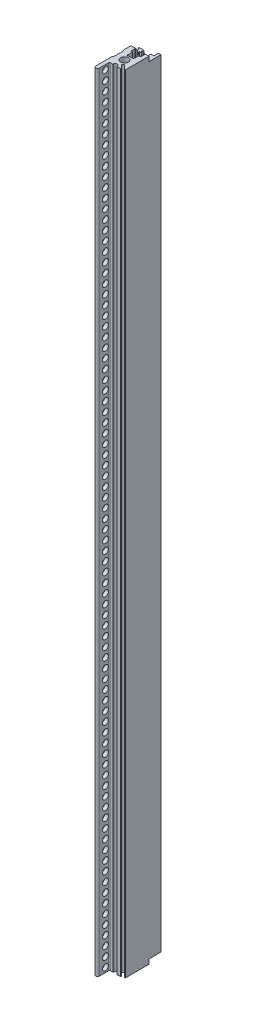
from build123d import *

# Parameters (mm, degrees)
SKETCH_1_R          = 1.6
EXTRUDE_1_DEPTH     = 215.9
SKETCH_7_W          = 5.4
SKETCH_7_H          = 2.5
SKETCH_7_H_2        = 1.2
CUT_EXTRUDE_6_DEPTH = 433.0893889
FILLET_1_R          = 0.2
SKETCH_2_R          = 2.1
CUT_EXTRUDE_1_DEPTH = 10
CUT_EXTRUDE_START   = -10
SKETCH_3_R          = 2.1
CUT_EXTRUDE_2_DEPTH = 10
SKETCH_4_R          = 1.65
CUT_EXTRUDE_3_DEPTH = 12
SKETCH_5_W          = 6.5
SKETCH_5_H          = 2.54
CUT_EXTRUDE_4_DEPTH = 10


with BuildPart() as part:
    # Sketch 1 → Extrude 1 (new, symmetric)
    with BuildSketch(Plane(origin=(0, 0, 0), x_dir=(1, 0, 0), z_dir=(0, 1, 0))):
        with BuildLine():
            Line((-4.20000049, 11.89999994), (-3.89999944, 11.899999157))
            ThreePointArc((-3.89999944, 11.899999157), (-3.758578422, 11.841420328), (-3.699999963, 11.699999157))
            Line((-3.699999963, 11.699999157), (-3.699999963, 9.94999994))
            ThreePointArc((-3.699999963, 9.94999994), (-3.758578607, 9.808578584), (-3.899999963, 9.74999994))
            Line((-3.899999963, 9.74999994), (-4.25, 9.74999994))
            ThreePointArc((-4.25, 9.74999994), (-4.391421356, 9.691421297), (-4.45, 9.54999994))
            Line((-4.45, 9.54999994), (-4.45, 8.5))
            Line((-4.45, 8.5), (-4.7, 8.5))
            Line((-4.7, 8.5), (-5, 8.2))
            Line((-5, 8.2), (-5, 7.4))
            Line((-5, 7.4), (-5, 4.4))
            Line((-5, 4.4), (-4.549867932, 3.899804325))
            Line((-4.549867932, 3.899804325), (-4.550132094, -1.100195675))
            Line((-4.550132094, -1.100195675), (-5, -1.6))
            Line((-5, -1.6), (-5, -10.75))
            ThreePointArc((-5, -10.75), (-4, -11.75), (-3, -10.75))
            Line((-3, -10.75), (-3, -5.75))
            ThreePointArc((-3, -5.75), (-2.853553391, -5.396446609), (-2.5, -5.25))
            Line((-2.5, -5.25), (-1.15000013, -5.25))
            ThreePointArc((-1.15000013, -5.25), (-1.079289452, -5.220710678), (-1.05000013, -5.15))
            Line((-1.05000013, -5.15), (-1.05000013, -5))
            ThreePointArc((-1.05000013, -5), (-1.3e-07, -3.95), (1.04999987, -5))
            Line((1.04999987, -5), (1.04999987, -5.15))
            ThreePointArc((1.04999987, -5.15), (1.079289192, -5.220710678), (1.14999987, -5.25))
            Line((1.14999987, -5.25), (3.070348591, -5.25))
            ThreePointArc((3.070348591, -5.25), (3.255124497, -5.126536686), (3.211769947, -4.908578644))
            Line((3.211769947, -4.908578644), (1.688730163, -3.385538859))
            ThreePointArc((1.688730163, -3.385538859), (1.688730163, -2.537010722), (2.5372583, -2.537010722))
            Line((2.5372583, -2.537010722), (4.658578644, -4.658331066))
            ThreePointArc((4.658578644, -4.658331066), (4.876536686, -4.701685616), (5, -4.516909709))
            Line((5, -4.516909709), (5, -2.080961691))
            Line((5, -2.080961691), (5, 5.179349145))
            Line((5, 5.179349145), (5, 15))
            Line((5, 15), (3.59999987, 15))
            Line((3.59999987, 15), (3.59999987, 12.5))
            Line((3.59999987, 12.5), (1.94999987, 12.5))
            Line((1.94999987, 12.5), (1.94999987, 10.55))
            Line((1.94999987, 10.55), (2.84999987, 10.55))
            Line((2.84999987, 10.55), (2.84999987, 9.35))
            Line((2.84999987, 9.35), (1.94999987, 9.35))
            Line((1.94999987, 9.35), (1.94999987, 8.35))
            Line((1.94999987, 8.35), (2.84999987, 8.35))
            Line((2.84999987, 8.35), (2.84999987, 6.05))
            Line((2.84999987, 6.05), (1.94999987, 6.05))
            Line((1.94999987, 6.05), (1.94999987, 3.885550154))
            ThreePointArc((1.94999987, 3.885550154), (1.567454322, 3.098943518), (0.71249987, 2.914162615))
            ThreePointArc((0.71249987, 2.914162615), (-0.242015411, 2.990222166), (-1.17187513, 2.761649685))
            ThreePointArc((-1.17187513, 2.761649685), (-1.360397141, 2.778988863), (-1.45000013, 2.945759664))
            Line((-1.45000013, 2.945759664), (-1.45000013, 6.05))
            Line((-1.45000013, 6.05), (-2.35000013, 6.05))
            Line((-2.35000013, 6.05), (-2.35000013, 8.35))
            Line((-2.35000013, 8.35), (-1.45000013, 8.35))
            Line((-1.45000013, 8.35), (-1.45000013, 9.35))
            Line((-1.45000013, 9.35), (-2.35000013, 9.35))
            Line((-2.35000013, 9.35), (-2.35000013, 10.55))
            Line((-2.35000013, 10.55), (-1.300000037, 10.55))
            Line((-1.300000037, 10.55), (-1.300000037, 10.617157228))
            ThreePointArc((-1.300000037, 10.617157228), (-1.315224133, 10.693693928), (-1.358578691, 10.758578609))
            Line((-1.358578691, 10.758578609), (-1.941421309, 11.341421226))
            ThreePointArc((-1.941421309, 11.341421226), (-1.984775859, 11.406305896), (-1.999999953, 11.482842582))
            Line((-1.999999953, 11.482842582), (-1.999999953, 11.699999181))
            ThreePointArc((-1.999999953, 11.699999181), (-1.941421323, 11.841420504), (-1.8, 11.899999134))
            Line((-1.8, 11.899999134), (-1.7, 11.899999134))
            ThreePointArc((-1.7, 11.899999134), (-1.558578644, 11.958577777), (-1.5, 12.099999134))
            Line((-1.5, 12.099999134), (-1.5, 12.199999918))
            ThreePointArc((-1.5, 12.199999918), (-1.558578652, 12.341421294), (-1.700000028, 12.399999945))
            Line((-1.700000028, 12.399999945), (-1.867157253, 12.399999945))
            ThreePointArc((-1.867157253, 12.399999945), (-1.943693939, 12.415224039), (-2.008578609, 12.458578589))
            Line((-2.008578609, 12.458578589), (-2.050000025, 12.500000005))
            Line((-2.050000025, 12.500000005), (-3.849999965, 12.500000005))
            Line((-3.849999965, 12.500000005), (-3.891421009, 12.458578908))
            ThreePointArc((-3.891421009, 12.458578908), (-3.95630571, 12.415224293), (-4.032842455, 12.400000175))
            Line((-4.032842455, 12.400000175), (-4.199999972, 12.400000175))
            ThreePointArc((-4.199999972, 12.400000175), (-4.341421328, 12.341421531), (-4.399999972, 12.200000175))
            Line((-4.399999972, 12.200000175), (-4.399999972, 12.099999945))
            ThreePointArc((-4.399999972, 12.099999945), (-4.341421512, 11.95857877), (-4.20000049, 11.89999994))
        make_face()
        with Locations(Location((-1.3e-07, 0, 0), (0, 0, 270))):
            Circle(SKETCH_1_R, mode=Mode.SUBTRACT)
    extrude(amount=EXTRUDE_1_DEPTH, both=True)

    # Sketch 7 → Cut-Extrude 6 (cut, through all)
    with BuildSketch(Plane(origin=(0, 215.9, 0), x_dir=(1, 0, 0), z_dir=(0, 1, 0))):
        with Locations((0.24999987, 7.1)):
            Rectangle(SKETCH_7_W, SKETCH_7_H)
        with Locations((0.24999987, 9.95)):
            Rectangle(SKETCH_7_W, SKETCH_7_H_2)
    extrude(amount=-CUT_EXTRUDE_6_DEPTH, mode=Mode.SUBTRACT)

    # Fillet 1
    fillet_1_edges = [part.edges().sort_by_distance(p)[0] for p in [
        (2.94999987, 0, -5.85),
        (-2.45000013, 0, -8.35),
        (2.94999987, 0, -8.35),
        (-2.45000013, 0, -5.85),
        (2.94999987, 0, -9.35),
        (-2.45000013, 0, -10.55),
        (2.94999987, 0, -10.55),
        (-2.45000013, 0, -9.35),
    ]]
    fillet(fillet_1_edges, radius=FILLET_1_R)

    # Sketch 2 → Cut-Extrude 1 (cut)
    with BuildSketch(Plane(origin=(0, 215.9, 0), x_dir=(1, 0, 0), z_dir=(0, 1, 0))):
        with Locations(Location((0, 0, 0), (0, 0, 270))):
            Circle(SKETCH_2_R)
    extrude(amount=-CUT_EXTRUDE_1_DEPTH, mode=Mode.SUBTRACT)

    # Sketch 3 → Cut-Extrude 2 (cut)
    with BuildSketch(Plane.XZ.offset(215.9).offset(CUT_EXTRUDE_START)):
        with Locations(Location((0, 0, 0), (0, 0, 90))):
            Circle(SKETCH_3_R)
    extrude(amount=CUT_EXTRUDE_2_DEPTH, mode=Mode.SUBTRACT)

    # Sketch 4 → Cut-Extrude 3 (cut)
    with BuildSketch(Plane.ZY.offset(5)):
        with Locations((7.5, -213.36)):
            Circle(SKETCH_4_R)
        with Locations((7.5, -208.28)):
            Circle(SKETCH_4_R)
        with Locations((7.5, -203.2)):
            Circle(SKETCH_4_R)
        with Locations((7.5, -198.12)):
            Circle(SKETCH_4_R)
        with Locations((7.5, -193.04)):
            Circle(SKETCH_4_R)
        with Locations((7.5, -187.96)):
            Circle(SKETCH_4_R)
        with Locations((7.5, -182.88)):
            Circle(SKETCH_4_R)
        with Locations((7.5, -177.8)):
            Circle(SKETCH_4_R)
        with Locations((7.5, -172.72)):
            Circle(SKETCH_4_R)
        with Locations((7.5, -167.64)):
            Circle(SKETCH_4_R)
        with Locations((7.5, -162.56)):
            Circle(SKETCH_4_R)
        with Locations((7.5, -157.48)):
            Circle(SKETCH_4_R)
        with Locations((7.5, -152.4)):
            Circle(SKETCH_4_R)
        with Locations((7.5, -147.32)):
            Circle(SKETCH_4_R)
        with Locations((7.5, -142.24)):
            Circle(SKETCH_4_R)
        with Locations((7.5, -137.16)):
            Circle(SKETCH_4_R)
        with Locations((7.5, -132.08)):
            Circle(SKETCH_4_R)
        with Locations((7.5, -127)):
            Circle(SKETCH_4_R)
        with Locations((7.5, -121.92)):
            Circle(SKETCH_4_R)
        with Locations((7.5, -116.84)):
            Circle(SKETCH_4_R)
        with Locations((7.5, -111.76)):
            Circle(SKETCH_4_R)
        with Locations((7.5, -106.68)):
            Circle(SKETCH_4_R)
        with Locations((7.5, -101.6)):
            Circle(SKETCH_4_R)
        with Locations((7.5, -96.52)):
            Circle(SKETCH_4_R)
        with Locations((7.5, -91.44)):
            Circle(SKETCH_4_R)
        with Locations((7.5, -86.36)):
            Circle(SKETCH_4_R)
        with Locations((7.5, -81.28)):
            Circle(SKETCH_4_R)
        with Locations((7.5, -76.2)):
            Circle(SKETCH_4_R)
        with Locations((7.5, -71.12)):
            Circle(SKETCH_4_R)
        with Locations((7.5, -66.04)):
            Circle(SKETCH_4_R)
        with Locations((7.5, -60.96)):
            Circle(SKETCH_4_R)
        with Locations((7.5, -55.88)):
            Circle(SKETCH_4_R)
        with Locations((7.5, -50.8)):
            Circle(SKETCH_4_R)
        with Locations((7.5, -45.72)):
            Circle(SKETCH_4_R)
        with Locations((7.5, -40.64)):
            Circle(SKETCH_4_R)
        with Locations((7.5, -35.56)):
            Circle(SKETCH_4_R)
        with Locations((7.5, -30.48)):
            Circle(SKETCH_4_R)
        with Locations((7.5, -25.4)):
            Circle(SKETCH_4_R)
        with Locations((7.5, -20.32)):
            Circle(SKETCH_4_R)
        with Locations((7.5, -15.24)):
            Circle(SKETCH_4_R)
        with Locations((7.5, -10.16)):
            Circle(SKETCH_4_R)
        with Locations((7.5, -5.08)):
            Circle(SKETCH_4_R)
        with Locations((7.5, 0)):
            Circle(SKETCH_4_R)
        with Locations((7.5, 5.08)):
            Circle(SKETCH_4_R)
        with Locations((7.5, 10.16)):
            Circle(SKETCH_4_R)
        with Locations((7.5, 15.24)):
            Circle(SKETCH_4_R)
        with Locations((7.5, 20.32)):
            Circle(SKETCH_4_R)
        with Locations((7.5, 25.4)):
            Circle(SKETCH_4_R)
        with Locations((7.5, 30.48)):
            Circle(SKETCH_4_R)
        with Locations((7.5, 35.56)):
            Circle(SKETCH_4_R)
        with Locations((7.5, 40.64)):
            Circle(SKETCH_4_R)
        with Locations((7.5, 45.72)):
            Circle(SKETCH_4_R)
        with Locations((7.5, 50.8)):
            Circle(SKETCH_4_R)
        with Locations((7.5, 55.88)):
            Circle(SKETCH_4_R)
        with Locations((7.5, 60.96)):
            Circle(SKETCH_4_R)
        with Locations((7.5, 66.04)):
            Circle(SKETCH_4_R)
        with Locations((7.5, 71.12)):
            Circle(SKETCH_4_R)
        with Locations((7.5, 76.2)):
            Circle(SKETCH_4_R)
        with Locations((7.5, 81.28)):
            Circle(SKETCH_4_R)
        with Locations((7.5, 86.36)):
            Circle(SKETCH_4_R)
        with Locations((7.5, 91.44)):
            Circle(SKETCH_4_R)
        with Locations((7.5, 96.52)):
            Circle(SKETCH_4_R)
        with Locations((7.5, 101.6)):
            Circle(SKETCH_4_R)
        with Locations((7.5, 106.68)):
            Circle(SKETCH_4_R)
        with Locations((7.5, 111.76)):
            Circle(SKETCH_4_R)
        with Locations((7.5, 116.84)):
            Circle(SKETCH_4_R)
        with Locations((7.5, 121.92)):
            Circle(SKETCH_4_R)
        with Locations((7.5, 127)):
            Circle(SKETCH_4_R)
        with Locations((7.5, 132.08)):
            Circle(SKETCH_4_R)
        with Locations((7.5, 137.16)):
            Circle(SKETCH_4_R)
        with Locations((7.5, 142.24)):
            Circle(SKETCH_4_R)
        with Locations((7.5, 147.32)):
            Circle(SKETCH_4_R)
        with Locations((7.5, 152.4)):
            Circle(SKETCH_4_R)
        with Locations((7.5, 157.48)):
            Circle(SKETCH_4_R)
        with Locations((7.5, 162.56)):
            Circle(SKETCH_4_R)
        with Locations((7.5, 167.64)):
            Circle(SKETCH_4_R)
        with Locations((7.5, 172.72)):
            Circle(SKETCH_4_R)
        with Locations((7.5, 177.8)):
            Circle(SKETCH_4_R)
        with Locations((7.5, 182.88)):
            Circle(SKETCH_4_R)
        with Locations((7.5, 187.96)):
            Circle(SKETCH_4_R)
        with Locations((7.5, 193.04)):
            Circle(SKETCH_4_R)
        with Locations((7.5, 198.12)):
            Circle(SKETCH_4_R)
        with Locations((7.5, 203.2)):
            Circle(SKETCH_4_R)
        with Locations((7.5, 208.28)):
            Circle(SKETCH_4_R)
        with Locations((7.5, 213.36)):
            Circle(SKETCH_4_R)
    extrude(amount=-CUT_EXTRUDE_3_DEPTH, mode=Mode.SUBTRACT)

    # Sketch 5 → Cut-Extrude 4 (cut)
    with BuildSketch(Plane(origin=(5, 0, 0), x_dir=(0, 0, -1), z_dir=(1, 0, 0))):
        with Locations((11.75, 214.63)):
            Rectangle(SKETCH_5_W, SKETCH_5_H)
        with Locations((11.75, -214.63)):
            Rectangle(SKETCH_5_W, SKETCH_5_H)
    extrude(amount=-CUT_EXTRUDE_4_DEPTH, mode=Mode.SUBTRACT)


solid = part.part
